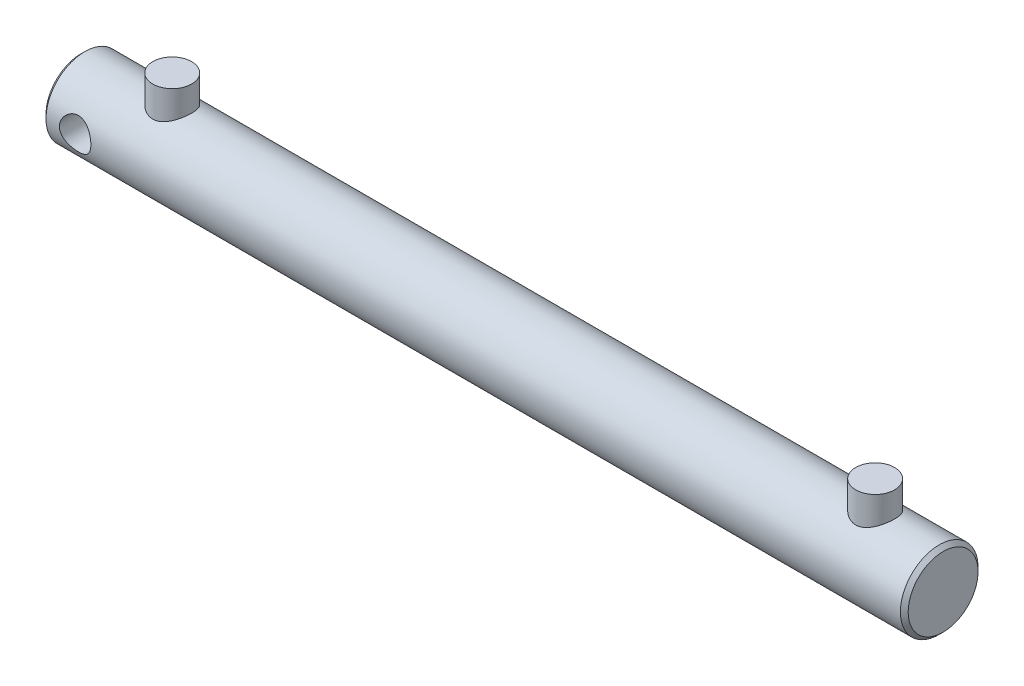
from build123d import *

# Parameters (mm, degrees)
ESQUISSE1_W                  = 444
ESQUISSE1_H                  = 20
CHANFREIN1_SIZE              = 2
ENL_V_MAT_EXTRU_1_DEPTH      = 224.794548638
ENL_V_MAT_EXTRU_1_DEPTH_BACK = 224.794548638
ESQUISSE3_R                  = 8.1
ESQUISSE5_R                  = 10
EXTRUSION2_DEPTH             = 33


with BuildPart() as part:
    # Esquisse1 → R_volution1 (revolve)
    with BuildSketch(Plane.XY, mode=Mode.PRIVATE) as r_volution1_sk:
        with Locations((0, 10)):
            Rectangle(ESQUISSE1_W, ESQUISSE1_H)
    revolve(r_volution1_sk.sketch.rotate(Axis((-222, 0, 0), (1, 0, 0)), 90), axis=Axis((-222, 0, 0), (1, 0, 0)))

    # Chanfrein1
    chanfrein1_edges = [part.edges().sort_by_distance(p)[0] for p in [
        (222, 0, -20),
        (-222, 0, -20),
    ]]
    chamfer(chanfrein1_edges, length=CHANFREIN1_SIZE)

    # Esquisse3 → Enl_v. mat.-Extru.1 (cut, two sides: drawn at the far end of the back side and taken through both)
    with BuildSketch(Plane.XY.offset(-ENL_V_MAT_EXTRU_1_DEPTH_BACK)):
        with Locations((-205, 0)):
            Circle(ESQUISSE3_R)
    extrude(amount=ENL_V_MAT_EXTRU_1_DEPTH + ENL_V_MAT_EXTRU_1_DEPTH_BACK, mode=Mode.SUBTRACT)

    # Esquisse5 → Extrusion2 (add)
    with BuildSketch(Plane(origin=(0, 0, 0), x_dir=(1, 0, 0), z_dir=(0, 1, 0))):
        with Locations(Location((-175, 0, 0), (0, 0, 90))):
            Circle(ESQUISSE5_R)
        with Locations(Location((187, 0, 0), (0, 0, 90))):
            Circle(ESQUISSE5_R)
    extrude(amount=EXTRUSION2_DEPTH)


solid = part.part
